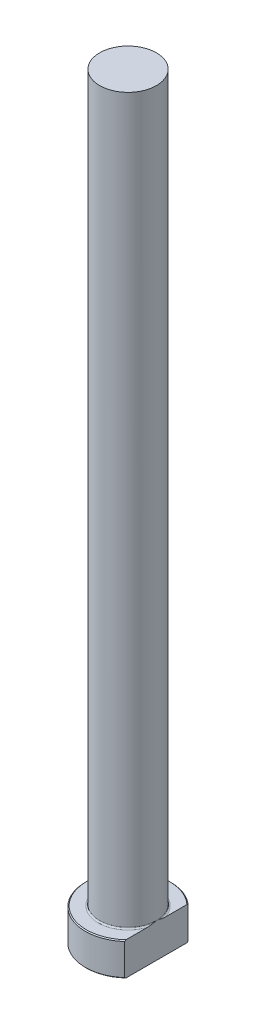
from build123d import *
from build123d.topology import SkipClean

# Parameters (mm, degrees)
CHAMFER1_SIZE = 0.2
FILLET1_R     = 0.3
KEY_DEPTH     = 161.505451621


with BuildPart() as part:
    # Sketch1 → Revolve1 (revolve)
    with BuildSketch(Plane.XY, mode=Mode.PRIVATE) as revolve1_sk:
        Polygon((0, 0), (-9, 0), (-9, 7), (-6, 7), (-6, 160), (0, 160), align=None)
    revolve(revolve1_sk.sketch.rotate(Axis((0, 259.958771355, 0), (0, -1, 0)), 270), axis=Axis((0, 259.958771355, 0), (0, -1, 0)))

    # Chamfer1
    chamfer1_edges = [part.edges().sort_by_distance(p)[0] for p in [
        (0, 7, -9),
        (0, 0, -9),
    ]]
    chamfer(chamfer1_edges, length=CHAMFER1_SIZE)

    # Fillet1
    fillet1_edges = [part.edges().sort_by_distance(p)[0] for p in [
        (0, 7, -6),
    ]]
    fillet(fillet1_edges, radius=FILLET1_R)

    # Sketch2 → KEY (cut, through all)
    with SkipClean():  # the faces are left unmerged after this step: merging them gives an invalid solid
        with BuildSketch(Plane(origin=(0, 0, 0), x_dir=(1, 0, 0), z_dir=(0, 1, 0))):
            with BuildLine():
                Line((6, 6.708203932), (6, -6.708203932))
                ThreePointArc((6, -6.708203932), (9, 0), (6, 6.708203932))
            make_face()
        extrude(amount=KEY_DEPTH, mode=Mode.SUBTRACT)


solid = part.part
